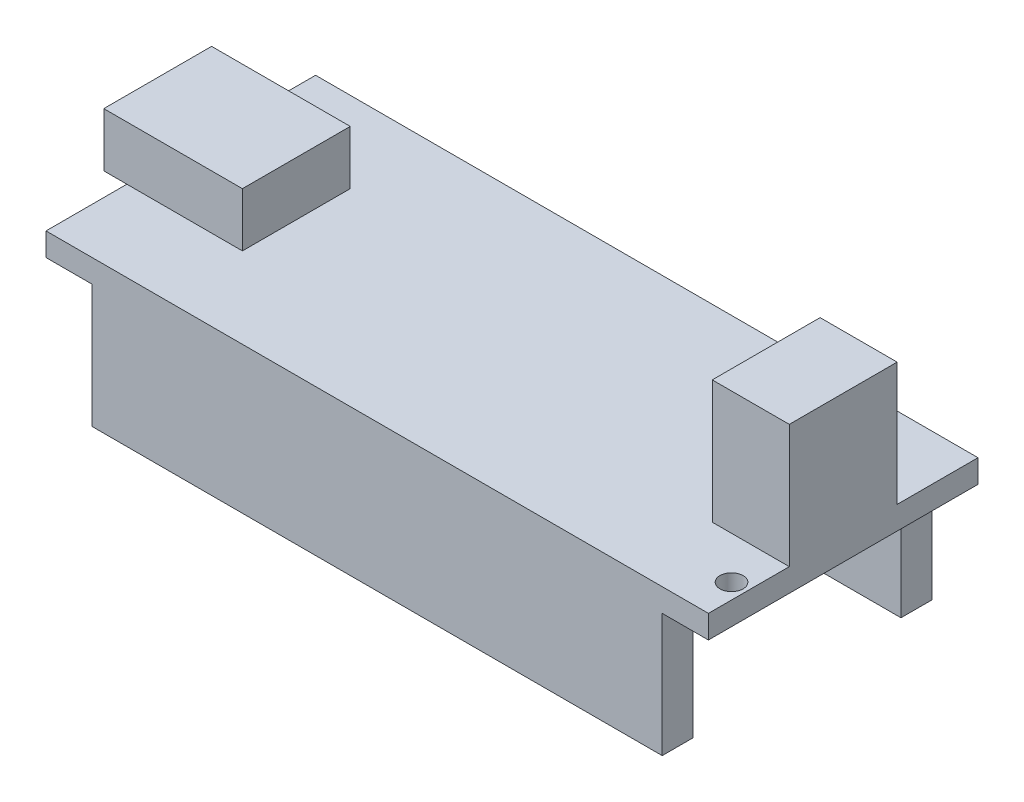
from build123d import *

# Parameters (mm, degrees)
SKETCH1_W           = 43
SKETCH1_H           = 17.5
SKETCH1_R           = 0.75
BOSS_EXTRUDE1_DEPTH = 1.5
SKETCH2_W           = 9
SKETCH2_H           = 7
BOSS_EXTRUDE2_DEPTH = 3.5
SKETCH3_W           = 5
SKETCH3_H           = 7
BOSS_EXTRUDE3_DEPTH = 8
SKETCH4_W           = 37
SKETCH4_H           = 2
BOSS_EXTRUDE4_DEPTH = 8


with BuildPart() as part:
    # Sketch1 → Boss-Extrude1 (new body)
    with BuildSketch(Plane(origin=(0, 0, 0), x_dir=(1, 0, 0), z_dir=(0, 1, 0))):
        Rectangle(SKETCH1_W, SKETCH1_H)
        with Locations(Location((20.5, -6.25, 0), (0, 0, 270))):
            Circle(SKETCH1_R, mode=Mode.SUBTRACT)
    extrude(amount=BOSS_EXTRUDE1_DEPTH)

    # Sketch2 → Boss-Extrude2 (add)
    with BuildSketch(Plane(origin=(0, 1.5, 0), x_dir=(1, 0, 0), z_dir=(0, 1, 0))):
        with Locations((-18.5, 0)):
            Rectangle(SKETCH2_W, SKETCH2_H)
    extrude(amount=BOSS_EXTRUDE2_DEPTH)

    # Sketch3 → Boss-Extrude3 (add)
    with BuildSketch(Plane(origin=(0, 1.5, 0), x_dir=(1, 0, 0), z_dir=(0, 1, 0))):
        with Locations((19, 0)):
            Rectangle(SKETCH3_W, SKETCH3_H)
    extrude(amount=BOSS_EXTRUDE3_DEPTH)

    # Sketch4 → Boss-Extrude4 (add)
    with BuildSketch(Plane.XZ):
        with Locations((0, 7.75)):
            Rectangle(SKETCH4_W, SKETCH4_H)
        with Locations((0, -7.75)):
            Rectangle(SKETCH4_W, SKETCH4_H)
    extrude(amount=BOSS_EXTRUDE4_DEPTH)


solid = part.part
